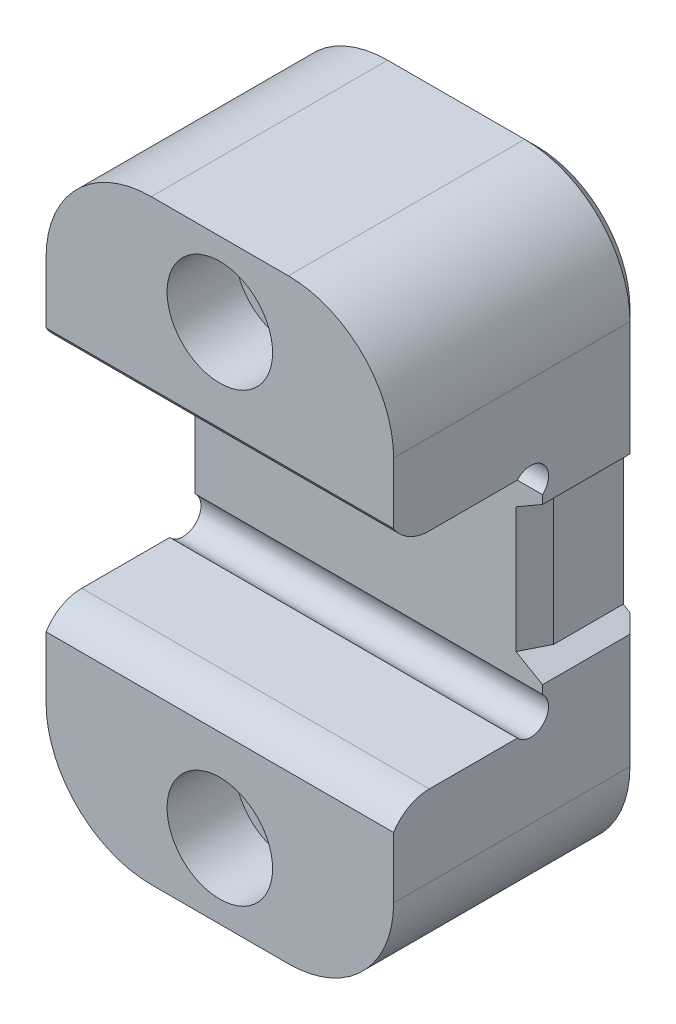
ISO-10303-21;
HEADER;
FILE_DESCRIPTION(('STEP AP214'),'2;1');
FILE_NAME('part.step','',(''),(''),'','','');
FILE_SCHEMA(('AUTOMOTIVE_DESIGN { 1 0 10303 214 1 1 1 1 }'));
ENDSEC;
DATA;
#1=APPLICATION_CONTEXT('core data for automotive mechanical design processes');
#2=APPLICATION_PROTOCOL_DEFINITION('international standard','automotive_design',2000,#1);
#3=PRODUCT_CONTEXT('',#1,'mechanical');
#4=PRODUCT('Part','Part','',(#3));
#5=PRODUCT_RELATED_PRODUCT_CATEGORY('part','',(#4));
#6=PRODUCT_DEFINITION_FORMATION('','',#4);
#7=PRODUCT_DEFINITION_CONTEXT('part definition',#1,'design');
#8=PRODUCT_DEFINITION('design','',#6,#7);
#9=PRODUCT_DEFINITION_SHAPE('','',#8);
#10=(LENGTH_UNIT() NAMED_UNIT(*) SI_UNIT(.MILLI.,.METRE.));
#11=(NAMED_UNIT(*) PLANE_ANGLE_UNIT() SI_UNIT($,.RADIAN.));
#12=(NAMED_UNIT(*) SI_UNIT($,.STERADIAN.) SOLID_ANGLE_UNIT());
#13=UNCERTAINTY_MEASURE_WITH_UNIT(LENGTH_MEASURE(1.E-05),#10,'distance_accuracy_value','');
#14=(GEOMETRIC_REPRESENTATION_CONTEXT(3) GLOBAL_UNCERTAINTY_ASSIGNED_CONTEXT((#13)) GLOBAL_UNIT_ASSIGNED_CONTEXT((#10,
#11,#12)) REPRESENTATION_CONTEXT('',''));
#15=CARTESIAN_POINT('',(0.,0.,0.));
#16=DIRECTION('',(0.,0.,1.));
#17=DIRECTION('',(1.,0.,0.));
#18=AXIS2_PLACEMENT_3D('',#15,#16,#17);
#19=CARTESIAN_POINT('',(22.225,14.2875,-19.05));
#20=DIRECTION('',(0.,0.,-1.));
#21=DIRECTION('',(-1.,0.,0.));
#22=AXIS2_PLACEMENT_3D('',#19,#20,#21);
#23=PLANE('',#22);
#24=DIRECTION('',(0.866025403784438,-0.500000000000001,0.));
#25=VECTOR('',#24,1.);
#26=CARTESIAN_POINT('',(11.7154475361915,-3.91557883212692,-19.05));
#27=LINE('',#26,#25);
#28=CARTESIAN_POINT('',(18.8228635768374,-8.01904739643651,-19.05));
#29=VERTEX_POINT('',#28);
#30=CARTESIAN_POINT('',(22.225,-9.98327177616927,-19.05));
#31=VERTEX_POINT('',#30);
#32=EDGE_CURVE('E427',#29,#31,#27,.T.);
#33=ORIENTED_EDGE('',*,*,#32,.F.);
#34=DIRECTION('',(0.,1.,0.));
#35=VECTOR('',#34,1.);
#36=CARTESIAN_POINT('',(18.8228635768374,8.60845644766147,-19.05));
#37=LINE('',#36,#35);
#38=CARTESIAN_POINT('',(18.8228635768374,8.01904739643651,-19.05));
#39=VERTEX_POINT('',#38);
#40=EDGE_CURVE('E294',#29,#39,#37,.T.);
#41=ORIENTED_EDGE('',*,*,#40,.T.);
#42=DIRECTION('',(-0.866025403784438,-0.500000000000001,0.));
#43=VECTOR('',#42,1.);
#44=CARTESIAN_POINT('',(24.0887854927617,11.059328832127,-19.05));
#45=LINE('',#44,#43);
#46=CARTESIAN_POINT('',(22.225,9.98327177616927,-19.05));
#47=VERTEX_POINT('',#46);
#48=EDGE_CURVE('E425',#47,#39,#45,.T.);
#49=ORIENTED_EDGE('',*,*,#48,.F.);
#50=DIRECTION('',(0.,-1.,0.));
#51=VECTOR('',#50,1.);
#52=CARTESIAN_POINT('',(22.225,14.2875,-19.05));
#53=LINE('',#52,#51);
#54=CARTESIAN_POINT('',(22.225,11.0596162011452,-19.05));
#55=VERTEX_POINT('',#54);
#56=EDGE_CURVE('E436',#55,#47,#53,.T.);
#57=ORIENTED_EDGE('',*,*,#56,.F.);
#58=DIRECTION('',(1.,0.,0.));
#59=VECTOR('',#58,1.);
#60=CARTESIAN_POINT('',(-22.225,11.0596162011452,-19.05));
#61=LINE('',#60,#59);
#62=CARTESIAN_POINT('',(-22.225,11.0596162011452,-19.05));
#63=VERTEX_POINT('',#62);
#64=EDGE_CURVE('E391',#55,#63,#61,.F.);
#65=ORIENTED_EDGE('',*,*,#64,.T.);
#66=DIRECTION('',(0.,-1.,0.));
#67=VECTOR('',#66,1.);
#68=CARTESIAN_POINT('',(-22.225,14.2875,-19.05));
#69=LINE('',#68,#67);
#70=CARTESIAN_POINT('',(-22.225,-11.0596162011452,-19.05));
#71=VERTEX_POINT('',#70);
#72=EDGE_CURVE('E232',#63,#71,#69,.T.);
#73=ORIENTED_EDGE('',*,*,#72,.T.);
#74=DIRECTION('',(1.,0.,0.));
#75=VECTOR('',#74,1.);
#76=CARTESIAN_POINT('',(-22.225,-11.0596162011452,-19.05));
#77=LINE('',#76,#75);
#78=CARTESIAN_POINT('',(22.225,-11.0596162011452,-19.05));
#79=VERTEX_POINT('',#78);
#80=EDGE_CURVE('E212',#71,#79,#77,.T.);
#81=ORIENTED_EDGE('',*,*,#80,.T.);
#82=EDGE_CURVE('E435',#31,#79,#53,.T.);
#83=ORIENTED_EDGE('',*,*,#82,.F.);
#84=EDGE_LOOP('',(#33,#41,#49,#57,#65,#73,#81,#83));
#85=FACE_BOUND('',#84,.T.);
#86=ADVANCED_FACE('F32',(#85),#23,.F.);
#87=CARTESIAN_POINT('',(22.225,38.1,-31.75));
#88=DIRECTION('',(0.,0.,1.));
#89=DIRECTION('',(1.,0.,0.));
#90=AXIS2_PLACEMENT_3D('',#87,#88,#89);
#91=PLANE('',#90);
#92=DIRECTION('',(0.866025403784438,-0.500000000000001,0.));
#93=VECTOR('',#92,1.);
#94=CARTESIAN_POINT('',(19.84375,-8.60845644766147,-31.75));
#95=LINE('',#94,#93);
#96=CARTESIAN_POINT('',(19.84375,-8.60845644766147,-31.75));
#97=VERTEX_POINT('',#96);
#98=CARTESIAN_POINT('',(20.701,-9.10338996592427,-31.75));
#99=VERTEX_POINT('',#98);
#100=EDGE_CURVE('E415',#97,#99,#95,.T.);
#101=ORIENTED_EDGE('',*,*,#100,.T.);
#102=DIRECTION('',(0.,-1.,0.));
#103=VECTOR('',#102,1.);
#104=CARTESIAN_POINT('',(20.701,38.1,-31.75));
#105=LINE('',#104,#103);
#106=CARTESIAN_POINT('',(20.701,-24.638,-31.75));
#107=VERTEX_POINT('',#106);
#108=EDGE_CURVE('E323',#99,#107,#105,.T.);
#109=ORIENTED_EDGE('',*,*,#108,.T.);
#110=CARTESIAN_POINT('',(8.763,-24.638,-31.75));
#111=DIRECTION('',(0.,0.,1.));
#112=DIRECTION('',(1.,0.,0.));
#113=AXIS2_PLACEMENT_3D('',#110,#111,#112);
#114=CIRCLE('',#113,11.938);
#115=CARTESIAN_POINT('',(8.763,-36.576,-31.75));
#116=VERTEX_POINT('',#115);
#117=EDGE_CURVE('E319',#107,#116,#114,.F.);
#118=ORIENTED_EDGE('',*,*,#117,.T.);
#119=DIRECTION('',(-1.,0.,0.));
#120=VECTOR('',#119,1.);
#121=CARTESIAN_POINT('',(22.225,-36.576,-31.75));
#122=LINE('',#121,#120);
#123=CARTESIAN_POINT('',(-8.763,-36.576,-31.75));
#124=VERTEX_POINT('',#123);
#125=EDGE_CURVE('E315',#116,#124,#122,.T.);
#126=ORIENTED_EDGE('',*,*,#125,.T.);
#127=CARTESIAN_POINT('',(-8.763,-24.638,-31.75));
#128=DIRECTION('',(0.,0.,1.));
#129=DIRECTION('',(1.,0.,0.));
#130=AXIS2_PLACEMENT_3D('',#127,#128,#129);
#131=CIRCLE('',#130,11.938);
#132=CARTESIAN_POINT('',(-20.701,-24.638,-31.75));
#133=VERTEX_POINT('',#132);
#134=EDGE_CURVE('E313',#124,#133,#131,.F.);
#135=ORIENTED_EDGE('',*,*,#134,.T.);
#136=DIRECTION('',(0.,1.,0.));
#137=VECTOR('',#136,1.);
#138=CARTESIAN_POINT('',(-20.701,24.638,-31.75));
#139=LINE('',#138,#137);
#140=CARTESIAN_POINT('',(-20.701,24.638,-31.75));
#141=VERTEX_POINT('',#140);
#142=EDGE_CURVE('E309',#133,#141,#139,.T.);
#143=ORIENTED_EDGE('',*,*,#142,.T.);
#144=CARTESIAN_POINT('',(-8.763,24.638,-31.75));
#145=DIRECTION('',(0.,0.,1.));
#146=DIRECTION('',(1.,0.,0.));
#147=AXIS2_PLACEMENT_3D('',#144,#145,#146);
#148=CIRCLE('',#147,11.938);
#149=CARTESIAN_POINT('',(-8.763,36.576,-31.75));
#150=VERTEX_POINT('',#149);
#151=EDGE_CURVE('E307',#141,#150,#148,.F.);
#152=ORIENTED_EDGE('',*,*,#151,.T.);
#153=DIRECTION('',(1.,0.,0.));
#154=VECTOR('',#153,1.);
#155=CARTESIAN_POINT('',(22.225,36.576,-31.75));
#156=LINE('',#155,#154);
#157=CARTESIAN_POINT('',(8.763,36.576,-31.75));
#158=VERTEX_POINT('',#157);
#159=EDGE_CURVE('E311',#150,#158,#156,.T.);
#160=ORIENTED_EDGE('',*,*,#159,.T.);
#161=CARTESIAN_POINT('',(8.763,24.638,-31.75));
#162=DIRECTION('',(0.,0.,1.));
#163=DIRECTION('',(1.,0.,0.));
#164=AXIS2_PLACEMENT_3D('',#161,#162,#163);
#165=CIRCLE('',#164,11.938);
#166=CARTESIAN_POINT('',(20.701,24.638,-31.75));
#167=VERTEX_POINT('',#166);
#168=EDGE_CURVE('E317',#158,#167,#165,.F.);
#169=ORIENTED_EDGE('',*,*,#168,.T.);
#170=DIRECTION('',(0.,-1.,0.));
#171=VECTOR('',#170,1.);
#172=CARTESIAN_POINT('',(20.701,38.1,-31.75));
#173=LINE('',#172,#171);
#174=CARTESIAN_POINT('',(20.701,9.10338996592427,-31.75));
#175=VERTEX_POINT('',#174);
#176=EDGE_CURVE('E321',#167,#175,#173,.T.);
#177=ORIENTED_EDGE('',*,*,#176,.T.);
#178=DIRECTION('',(-0.866025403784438,-0.500000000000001,0.));
#179=VECTOR('',#178,1.);
#180=CARTESIAN_POINT('',(19.84375,8.60845644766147,-31.75));
#181=LINE('',#180,#179);
#182=CARTESIAN_POINT('',(19.84375,8.60845644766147,-31.75));
#183=VERTEX_POINT('',#182);
#184=EDGE_CURVE('E418',#175,#183,#181,.T.);
#185=ORIENTED_EDGE('',*,*,#184,.T.);
#186=DIRECTION('',(0.,-1.,0.));
#187=VECTOR('',#186,1.);
#188=CARTESIAN_POINT('',(19.84375,8.60845644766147,-31.75));
#189=LINE('',#188,#187);
#190=EDGE_CURVE('E411',#183,#97,#189,.T.);
#191=ORIENTED_EDGE('',*,*,#190,.T.);
#192=EDGE_LOOP('',(#101,#109,#118,#126,#135,#143,#152,#160,#169,#177,#185,#191));
#193=FACE_BOUND('',#192,.T.);
#194=CARTESIAN_POINT('',(0.,28.575,-31.75));
#195=DIRECTION('',(0.,0.,1.));
#196=DIRECTION('',(1.,0.,0.));
#197=AXIS2_PLACEMENT_3D('',#194,#195,#196);
#198=CIRCLE('',#197,4.10209999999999);
#199=CARTESIAN_POINT('',(4.10209999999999,28.575,-31.75));
#200=VERTEX_POINT('',#199);
#201=EDGE_CURVE('E288',#200,#200,#198,.T.);
#202=ORIENTED_EDGE('',*,*,#201,.T.);
#203=EDGE_LOOP('',(#202));
#204=FACE_BOUND('',#203,.T.);
#205=CARTESIAN_POINT('',(0.,-28.575,-31.75));
#206=DIRECTION('',(0.,0.,1.));
#207=DIRECTION('',(1.,0.,0.));
#208=AXIS2_PLACEMENT_3D('',#205,#206,#207);
#209=CIRCLE('',#208,4.10209999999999);
#210=CARTESIAN_POINT('',(4.10209999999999,-28.575,-31.75));
#211=VERTEX_POINT('',#210);
#212=EDGE_CURVE('E283',#211,#211,#209,.T.);
#213=ORIENTED_EDGE('',*,*,#212,.T.);
#214=EDGE_LOOP('',(#213));
#215=FACE_BOUND('',#214,.T.);
#216=ADVANCED_FACE('F545',(#193,#204,#215),#91,.F.);
#217=CARTESIAN_POINT('',(22.225,-14.2875,0.));
#218=DIRECTION('',(-1.,0.,0.));
#219=DIRECTION('',(0.,0.,1.));
#220=AXIS2_PLACEMENT_3D('',#217,#218,#219);
#221=PLANE('',#220);
#222=DIRECTION('',(0.,0.,-1.));
#223=VECTOR('',#222,1.);
#224=CARTESIAN_POINT('',(22.225,-24.638,0.));
#225=LINE('',#224,#223);
#226=CARTESIAN_POINT('',(22.225,-24.638,0.));
#227=VERTEX_POINT('',#226);
#228=CARTESIAN_POINT('',(22.225,-24.638,-30.226));
#229=VERTEX_POINT('',#228);
#230=EDGE_CURVE('E250',#227,#229,#225,.T.);
#231=ORIENTED_EDGE('',*,*,#230,.T.);
#232=DIRECTION('',(0.,1.,0.));
#233=VECTOR('',#232,1.);
#234=CARTESIAN_POINT('',(22.225,-14.2875,-30.226));
#235=LINE('',#234,#233);
#236=CARTESIAN_POINT('',(22.225,-9.98327177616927,-30.226));
#237=VERTEX_POINT('',#236);
#238=EDGE_CURVE('E302',#229,#237,#235,.T.);
#239=ORIENTED_EDGE('',*,*,#238,.T.);
#240=DIRECTION('',(0.,0.,-1.));
#241=VECTOR('',#240,1.);
#242=CARTESIAN_POINT('',(22.225,-9.98327177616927,0.));
#243=LINE('',#242,#241);
#244=EDGE_CURVE('E277',#31,#237,#243,.T.);
#245=ORIENTED_EDGE('',*,*,#244,.F.);
#246=ORIENTED_EDGE('',*,*,#82,.T.);
#247=CARTESIAN_POINT('',(22.225,-12.7635,-17.526));
#248=DIRECTION('',(1.,0.,0.));
#249=DIRECTION('',(0.,0.,1.));
#250=AXIS2_PLACEMENT_3D('',#247,#248,#249);
#251=CIRCLE('',#250,2.286);
#252=CARTESIAN_POINT('',(22.225,-14.2875,-15.8221162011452));
#253=VERTEX_POINT('',#252);
#254=EDGE_CURVE('E217',#253,#79,#251,.T.);
#255=ORIENTED_EDGE('',*,*,#254,.F.);
#256=DIRECTION('',(0.,0.,1.));
#257=VECTOR('',#256,1.);
#258=CARTESIAN_POINT('',(22.225,-14.2875,-19.05));
#259=LINE('',#258,#257);
#260=CARTESIAN_POINT('',(22.225,-14.2875,-4.57199999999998));
#261=VERTEX_POINT('',#260);
#262=EDGE_CURVE('E225',#253,#261,#259,.T.);
#263=ORIENTED_EDGE('',*,*,#262,.T.);
#264=CARTESIAN_POINT('',(22.225,-19.6722999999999,-4.57199999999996));
#265=DIRECTION('',(-1.,0.,0.));
#266=DIRECTION('',(0.,0.,1.));
#267=AXIS2_PLACEMENT_3D('',#264,#265,#266);
#268=CIRCLE('',#267,5.38479999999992);
#269=CARTESIAN_POINT('',(22.225,-16.8275,0.));
#270=VERTEX_POINT('',#269);
#271=EDGE_CURVE('E402',#270,#261,#268,.T.);
#272=ORIENTED_EDGE('',*,*,#271,.F.);
#273=DIRECTION('',(0.,-1.,0.));
#274=VECTOR('',#273,1.);
#275=CARTESIAN_POINT('',(22.225,-14.2875,0.));
#276=LINE('',#275,#274);
#277=EDGE_CURVE('E245',#270,#227,#276,.T.);
#278=ORIENTED_EDGE('',*,*,#277,.T.);
#279=EDGE_LOOP('',(#231,#239,#245,#246,#255,#263,#272,#278));
#280=FACE_BOUND('',#279,.T.);
#281=ADVANCED_FACE('F522',(#280),#221,.F.);
#282=DIRECTION('',(0.,0.,1.));
#283=VECTOR('',#282,1.);
#284=CARTESIAN_POINT('',(22.225,9.98327177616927,0.));
#285=LINE('',#284,#283);
#286=CARTESIAN_POINT('',(22.225,9.98327177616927,-30.226));
#287=VERTEX_POINT('',#286);
#288=EDGE_CURVE('E275',#287,#47,#285,.T.);
#289=ORIENTED_EDGE('',*,*,#288,.F.);
#290=DIRECTION('',(0.,1.,0.));
#291=VECTOR('',#290,1.);
#292=CARTESIAN_POINT('',(22.225,-14.2875,-30.226));
#293=LINE('',#292,#291);
#294=CARTESIAN_POINT('',(22.225,24.638,-30.226));
#295=VERTEX_POINT('',#294);
#296=EDGE_CURVE('E325',#287,#295,#293,.T.);
#297=ORIENTED_EDGE('',*,*,#296,.T.);
#298=DIRECTION('',(0.,0.,1.));
#299=VECTOR('',#298,1.);
#300=CARTESIAN_POINT('',(22.225,24.638,0.));
#301=LINE('',#300,#299);
#302=CARTESIAN_POINT('',(22.225,24.638,0.));
#303=VERTEX_POINT('',#302);
#304=EDGE_CURVE('E248',#295,#303,#301,.T.);
#305=ORIENTED_EDGE('',*,*,#304,.T.);
#306=DIRECTION('',(0.,-1.,0.));
#307=VECTOR('',#306,1.);
#308=CARTESIAN_POINT('',(22.225,38.1,0.));
#309=LINE('',#308,#307);
#310=CARTESIAN_POINT('',(22.225,16.8275,0.));
#311=VERTEX_POINT('',#310);
#312=EDGE_CURVE('E235',#303,#311,#309,.T.);
#313=ORIENTED_EDGE('',*,*,#312,.T.);
#314=CARTESIAN_POINT('',(22.225,19.6722999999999,-4.57199999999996));
#315=DIRECTION('',(-1.,0.,0.));
#316=DIRECTION('',(0.,0.,-1.));
#317=AXIS2_PLACEMENT_3D('',#314,#315,#316);
#318=CIRCLE('',#317,5.38479999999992);
#319=CARTESIAN_POINT('',(22.225,14.2875,-4.57199999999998));
#320=VERTEX_POINT('',#319);
#321=EDGE_CURVE('E394',#320,#311,#318,.T.);
#322=ORIENTED_EDGE('',*,*,#321,.F.);
#323=DIRECTION('',(0.,0.,-1.));
#324=VECTOR('',#323,1.);
#325=CARTESIAN_POINT('',(22.225,14.2875,0.));
#326=LINE('',#325,#324);
#327=CARTESIAN_POINT('',(22.225,14.2875,-15.8221162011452));
#328=VERTEX_POINT('',#327);
#329=EDGE_CURVE('E432',#320,#328,#326,.T.);
#330=ORIENTED_EDGE('',*,*,#329,.T.);
#331=CARTESIAN_POINT('',(22.225,12.7635,-17.526));
#332=DIRECTION('',(1.,0.,0.));
#333=DIRECTION('',(0.,0.,-1.));
#334=AXIS2_PLACEMENT_3D('',#331,#332,#333);
#335=CIRCLE('',#334,2.286);
#336=EDGE_CURVE('E386',#55,#328,#335,.T.);
#337=ORIENTED_EDGE('',*,*,#336,.F.);
#338=ORIENTED_EDGE('',*,*,#56,.T.);
#339=EDGE_LOOP('',(#289,#297,#305,#313,#322,#330,#337,#338));
#340=FACE_BOUND('',#339,.T.);
#341=ADVANCED_FACE('F458',(#340),#221,.F.);
#342=CARTESIAN_POINT('',(22.225,38.1,0.));
#343=DIRECTION('',(0.,0.,-1.));
#344=DIRECTION('',(0.,1.,0.));
#345=AXIS2_PLACEMENT_3D('',#342,#343,#344);
#346=PLANE('',#345);
#347=CARTESIAN_POINT('',(0.,28.575,0.));
#348=DIRECTION('',(0.,0.,1.));
#349=DIRECTION('',(1.,0.,0.));
#350=AXIS2_PLACEMENT_3D('',#347,#348,#349);
#351=CIRCLE('',#350,6.74751);
#352=CARTESIAN_POINT('',(6.74751,28.575,0.));
#353=VERTEX_POINT('',#352);
#354=EDGE_CURVE('E286',#353,#353,#351,.T.);
#355=ORIENTED_EDGE('',*,*,#354,.F.);
#356=EDGE_LOOP('',(#355));
#357=FACE_BOUND('',#356,.T.);
#358=DIRECTION('',(0.,-1.,0.));
#359=VECTOR('',#358,1.);
#360=CARTESIAN_POINT('',(-22.225,38.1,0.));
#361=LINE('',#360,#359);
#362=CARTESIAN_POINT('',(-22.225,24.638,0.));
#363=VERTEX_POINT('',#362);
#364=CARTESIAN_POINT('',(-22.225,16.8275,0.));
#365=VERTEX_POINT('',#364);
#366=EDGE_CURVE('E429',#363,#365,#361,.T.);
#367=ORIENTED_EDGE('',*,*,#366,.T.);
#368=DIRECTION('',(1.,0.,0.));
#369=VECTOR('',#368,1.);
#370=CARTESIAN_POINT('',(-22.225,16.8275,0.));
#371=LINE('',#370,#369);
#372=EDGE_CURVE('E398',#365,#311,#371,.T.);
#373=ORIENTED_EDGE('',*,*,#372,.T.);
#374=ORIENTED_EDGE('',*,*,#312,.F.);
#375=CARTESIAN_POINT('',(8.763,24.638,0.));
#376=DIRECTION('',(0.,0.,-1.));
#377=DIRECTION('',(0.,1.,0.));
#378=AXIS2_PLACEMENT_3D('',#375,#376,#377);
#379=CIRCLE('',#378,13.462);
#380=CARTESIAN_POINT('',(8.763,38.1,0.));
#381=VERTEX_POINT('',#380);
#382=EDGE_CURVE('E265',#303,#381,#379,.F.);
#383=ORIENTED_EDGE('',*,*,#382,.T.);
#384=DIRECTION('',(-1.,0.,0.));
#385=VECTOR('',#384,1.);
#386=CARTESIAN_POINT('',(22.225,38.1,0.));
#387=LINE('',#386,#385);
#388=CARTESIAN_POINT('',(-8.763,38.1,0.));
#389=VERTEX_POINT('',#388);
#390=EDGE_CURVE('E241',#381,#389,#387,.T.);
#391=ORIENTED_EDGE('',*,*,#390,.T.);
#392=CARTESIAN_POINT('',(-8.763,24.638,0.));
#393=DIRECTION('',(0.,0.,-1.));
#394=DIRECTION('',(0.,1.,0.));
#395=AXIS2_PLACEMENT_3D('',#392,#393,#394);
#396=CIRCLE('',#395,13.462);
#397=EDGE_CURVE('E263',#389,#363,#396,.F.);
#398=ORIENTED_EDGE('',*,*,#397,.T.);
#399=EDGE_LOOP('',(#367,#373,#374,#383,#391,#398));
#400=FACE_BOUND('',#399,.T.);
#401=ADVANCED_FACE('F465',(#357,#400),#346,.F.);
#402=CARTESIAN_POINT('',(22.225,14.2875,0.));
#403=DIRECTION('',(0.,1.,0.));
#404=DIRECTION('',(0.,0.,1.));
#405=AXIS2_PLACEMENT_3D('',#402,#403,#404);
#406=PLANE('',#405);
#407=DIRECTION('',(0.,0.,-1.));
#408=VECTOR('',#407,1.);
#409=CARTESIAN_POINT('',(-22.225,14.2875,0.));
#410=LINE('',#409,#408);
#411=CARTESIAN_POINT('',(-22.225,14.2875,-4.57199999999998));
#412=VERTEX_POINT('',#411);
#413=CARTESIAN_POINT('',(-22.225,14.2875,-15.8221162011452));
#414=VERTEX_POINT('',#413);
#415=EDGE_CURVE('E237',#412,#414,#410,.T.);
#416=ORIENTED_EDGE('',*,*,#415,.T.);
#417=DIRECTION('',(1.,0.,0.));
#418=VECTOR('',#417,1.);
#419=CARTESIAN_POINT('',(-22.225,14.2875,-15.8221162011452));
#420=LINE('',#419,#418);
#421=EDGE_CURVE('E388',#414,#328,#420,.T.);
#422=ORIENTED_EDGE('',*,*,#421,.T.);
#423=ORIENTED_EDGE('',*,*,#329,.F.);
#424=DIRECTION('',(1.,0.,0.));
#425=VECTOR('',#424,1.);
#426=CARTESIAN_POINT('',(-22.225,14.2875,-4.57199999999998));
#427=LINE('',#426,#425);
#428=EDGE_CURVE('E400',#412,#320,#427,.T.);
#429=ORIENTED_EDGE('',*,*,#428,.F.);
#430=EDGE_LOOP('',(#416,#422,#423,#429));
#431=FACE_BOUND('',#430,.T.);
#432=ADVANCED_FACE('F446',(#431),#406,.F.);
#433=CARTESIAN_POINT('',(22.225,-14.2875,-19.05));
#434=DIRECTION('',(0.,-1.,0.));
#435=DIRECTION('',(0.,0.,-1.));
#436=AXIS2_PLACEMENT_3D('',#433,#434,#435);
#437=PLANE('',#436);
#438=ORIENTED_EDGE('',*,*,#262,.F.);
#439=DIRECTION('',(1.,0.,0.));
#440=VECTOR('',#439,1.);
#441=CARTESIAN_POINT('',(-22.225,-14.2875,-15.8221162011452));
#442=LINE('',#441,#440);
#443=CARTESIAN_POINT('',(-22.225,-14.2875,-15.8221162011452));
#444=VERTEX_POINT('',#443);
#445=EDGE_CURVE('E209',#253,#444,#442,.F.);
#446=ORIENTED_EDGE('',*,*,#445,.T.);
#447=DIRECTION('',(0.,0.,1.));
#448=VECTOR('',#447,1.);
#449=CARTESIAN_POINT('',(-22.225,-14.2875,-19.05));
#450=LINE('',#449,#448);
#451=CARTESIAN_POINT('',(-22.225,-14.2875,-4.57199999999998));
#452=VERTEX_POINT('',#451);
#453=EDGE_CURVE('E223',#444,#452,#450,.T.);
#454=ORIENTED_EDGE('',*,*,#453,.T.);
#455=DIRECTION('',(1.,0.,0.));
#456=VECTOR('',#455,1.);
#457=CARTESIAN_POINT('',(-22.225,-14.2875,-4.57199999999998));
#458=LINE('',#457,#456);
#459=EDGE_CURVE('E406',#452,#261,#458,.T.);
#460=ORIENTED_EDGE('',*,*,#459,.T.);
#461=EDGE_LOOP('',(#438,#446,#454,#460));
#462=FACE_BOUND('',#461,.T.);
#463=ADVANCED_FACE('F221',(#462),#437,.F.);
#464=CARTESIAN_POINT('',(22.225,-14.2875,0.));
#465=DIRECTION('',(0.,0.,-1.));
#466=DIRECTION('',(0.,1.,0.));
#467=AXIS2_PLACEMENT_3D('',#464,#465,#466);
#468=PLANE('',#467);
#469=CARTESIAN_POINT('',(0.,-28.575,0.));
#470=DIRECTION('',(0.,0.,1.));
#471=DIRECTION('',(1.,0.,0.));
#472=AXIS2_PLACEMENT_3D('',#469,#470,#471);
#473=CIRCLE('',#472,6.74751);
#474=CARTESIAN_POINT('',(6.74751,-28.575,0.));
#475=VERTEX_POINT('',#474);
#476=EDGE_CURVE('E378',#475,#475,#473,.T.);
#477=ORIENTED_EDGE('',*,*,#476,.F.);
#478=EDGE_LOOP('',(#477));
#479=FACE_BOUND('',#478,.T.);
#480=ORIENTED_EDGE('',*,*,#277,.F.);
#481=DIRECTION('',(1.,0.,0.));
#482=VECTOR('',#481,1.);
#483=CARTESIAN_POINT('',(-22.225,-16.8275,0.));
#484=LINE('',#483,#482);
#485=CARTESIAN_POINT('',(-22.225,-16.8275,0.));
#486=VERTEX_POINT('',#485);
#487=EDGE_CURVE('E409',#486,#270,#484,.T.);
#488=ORIENTED_EDGE('',*,*,#487,.F.);
#489=DIRECTION('',(0.,-1.,0.));
#490=VECTOR('',#489,1.);
#491=CARTESIAN_POINT('',(-22.225,-14.2875,0.));
#492=LINE('',#491,#490);
#493=CARTESIAN_POINT('',(-22.225,-24.638,0.));
#494=VERTEX_POINT('',#493);
#495=EDGE_CURVE('E231',#486,#494,#492,.T.);
#496=ORIENTED_EDGE('',*,*,#495,.T.);
#497=CARTESIAN_POINT('',(-8.763,-24.638,0.));
#498=DIRECTION('',(0.,0.,-1.));
#499=DIRECTION('',(0.,1.,0.));
#500=AXIS2_PLACEMENT_3D('',#497,#498,#499);
#501=CIRCLE('',#500,13.462);
#502=CARTESIAN_POINT('',(-8.763,-38.1,0.));
#503=VERTEX_POINT('',#502);
#504=EDGE_CURVE('E258',#494,#503,#501,.F.);
#505=ORIENTED_EDGE('',*,*,#504,.T.);
#506=DIRECTION('',(-1.,0.,0.));
#507=VECTOR('',#506,1.);
#508=CARTESIAN_POINT('',(22.225,-38.1,0.));
#509=LINE('',#508,#507);
#510=CARTESIAN_POINT('',(8.763,-38.1,0.));
#511=VERTEX_POINT('',#510);
#512=EDGE_CURVE('E244',#511,#503,#509,.T.);
#513=ORIENTED_EDGE('',*,*,#512,.F.);
#514=CARTESIAN_POINT('',(8.763,-24.638,0.));
#515=DIRECTION('',(0.,0.,-1.));
#516=DIRECTION('',(0.,1.,0.));
#517=AXIS2_PLACEMENT_3D('',#514,#515,#516);
#518=CIRCLE('',#517,13.462);
#519=EDGE_CURVE('E260',#511,#227,#518,.F.);
#520=ORIENTED_EDGE('',*,*,#519,.T.);
#521=EDGE_LOOP('',(#480,#488,#496,#505,#513,#520));
#522=FACE_BOUND('',#521,.T.);
#523=ADVANCED_FACE('F496',(#479,#522),#468,.F.);
#524=CARTESIAN_POINT('',(22.225,-38.1,0.));
#525=DIRECTION('',(0.,1.,0.));
#526=DIRECTION('',(0.,0.,1.));
#527=AXIS2_PLACEMENT_3D('',#524,#525,#526);
#528=PLANE('',#527);
#529=DIRECTION('',(0.,0.,-1.));
#530=VECTOR('',#529,1.);
#531=CARTESIAN_POINT('',(-8.763,-38.1,-31.75));
#532=LINE('',#531,#530);
#533=CARTESIAN_POINT('',(-8.763,-38.1,-30.226));
#534=VERTEX_POINT('',#533);
#535=EDGE_CURVE('E253',#503,#534,#532,.T.);
#536=ORIENTED_EDGE('',*,*,#535,.T.);
#537=DIRECTION('',(1.,0.,0.));
#538=VECTOR('',#537,1.);
#539=CARTESIAN_POINT('',(22.225,-38.1,-30.226));
#540=LINE('',#539,#538);
#541=CARTESIAN_POINT('',(8.763,-38.1,-30.226));
#542=VERTEX_POINT('',#541);
#543=EDGE_CURVE('E333',#534,#542,#540,.T.);
#544=ORIENTED_EDGE('',*,*,#543,.T.);
#545=DIRECTION('',(0.,0.,-1.));
#546=VECTOR('',#545,1.);
#547=CARTESIAN_POINT('',(8.763,-38.1,0.));
#548=LINE('',#547,#546);
#549=EDGE_CURVE('E256',#542,#511,#548,.F.);
#550=ORIENTED_EDGE('',*,*,#549,.T.);
#551=ORIENTED_EDGE('',*,*,#512,.T.);
#552=EDGE_LOOP('',(#536,#544,#550,#551));
#553=FACE_BOUND('',#552,.T.);
#554=ADVANCED_FACE('F500',(#553),#528,.F.);
#555=CARTESIAN_POINT('',(22.225,38.1,0.));
#556=DIRECTION('',(0.,-1.,0.));
#557=DIRECTION('',(0.,0.,-1.));
#558=AXIS2_PLACEMENT_3D('',#555,#556,#557);
#559=PLANE('',#558);
#560=DIRECTION('',(0.,0.,1.));
#561=VECTOR('',#560,1.);
#562=CARTESIAN_POINT('',(8.763,38.1,0.));
#563=LINE('',#562,#561);
#564=CARTESIAN_POINT('',(8.763,38.1,-30.226));
#565=VERTEX_POINT('',#564);
#566=EDGE_CURVE('E269',#381,#565,#563,.F.);
#567=ORIENTED_EDGE('',*,*,#566,.T.);
#568=DIRECTION('',(-1.,0.,0.));
#569=VECTOR('',#568,1.);
#570=CARTESIAN_POINT('',(22.225,38.1,-30.226));
#571=LINE('',#570,#569);
#572=CARTESIAN_POINT('',(-8.763,38.1,-30.226));
#573=VERTEX_POINT('',#572);
#574=EDGE_CURVE('E55',#565,#573,#571,.T.);
#575=ORIENTED_EDGE('',*,*,#574,.T.);
#576=DIRECTION('',(0.,0.,1.));
#577=VECTOR('',#576,1.);
#578=CARTESIAN_POINT('',(-8.763,38.1,0.));
#579=LINE('',#578,#577);
#580=EDGE_CURVE('E267',#573,#389,#579,.T.);
#581=ORIENTED_EDGE('',*,*,#580,.T.);
#582=ORIENTED_EDGE('',*,*,#390,.F.);
#583=EDGE_LOOP('',(#567,#575,#581,#582));
#584=FACE_BOUND('',#583,.T.);
#585=ADVANCED_FACE('F473',(#584),#559,.F.);
#586=CARTESIAN_POINT('',(-22.225,-14.2875,0.));
#587=DIRECTION('',(-1.,0.,0.));
#588=DIRECTION('',(0.,0.,1.));
#589=AXIS2_PLACEMENT_3D('',#586,#587,#588);
#590=PLANE('',#589);
#591=DIRECTION('',(0.,0.,1.));
#592=VECTOR('',#591,1.);
#593=CARTESIAN_POINT('',(-22.225,24.638,-31.75));
#594=LINE('',#593,#592);
#595=CARTESIAN_POINT('',(-22.225,24.638,-30.226));
#596=VERTEX_POINT('',#595);
#597=EDGE_CURVE('E271',#363,#596,#594,.F.);
#598=ORIENTED_EDGE('',*,*,#597,.T.);
#599=DIRECTION('',(0.,-1.,0.));
#600=VECTOR('',#599,1.);
#601=CARTESIAN_POINT('',(-22.225,-24.638,-30.226));
#602=LINE('',#601,#600);
#603=CARTESIAN_POINT('',(-22.225,-24.638,-30.226));
#604=VERTEX_POINT('',#603);
#605=EDGE_CURVE('E41',#596,#604,#602,.T.);
#606=ORIENTED_EDGE('',*,*,#605,.T.);
#607=DIRECTION('',(0.,0.,-1.));
#608=VECTOR('',#607,1.);
#609=CARTESIAN_POINT('',(-22.225,-24.638,0.));
#610=LINE('',#609,#608);
#611=EDGE_CURVE('E273',#604,#494,#610,.F.);
#612=ORIENTED_EDGE('',*,*,#611,.T.);
#613=ORIENTED_EDGE('',*,*,#495,.F.);
#614=CARTESIAN_POINT('',(-22.225,-19.6722999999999,-4.57199999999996));
#615=DIRECTION('',(-1.,0.,0.));
#616=DIRECTION('',(0.,0.,1.));
#617=AXIS2_PLACEMENT_3D('',#614,#615,#616);
#618=CIRCLE('',#617,5.38479999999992);
#619=EDGE_CURVE('E230',#486,#452,#618,.T.);
#620=ORIENTED_EDGE('',*,*,#619,.T.);
#621=ORIENTED_EDGE('',*,*,#453,.F.);
#622=CARTESIAN_POINT('',(-22.225,-12.7635,-17.526));
#623=DIRECTION('',(1.,0.,0.));
#624=DIRECTION('',(0.,0.,1.));
#625=AXIS2_PLACEMENT_3D('',#622,#623,#624);
#626=CIRCLE('',#625,2.286);
#627=EDGE_CURVE('E206',#444,#71,#626,.T.);
#628=ORIENTED_EDGE('',*,*,#627,.T.);
#629=ORIENTED_EDGE('',*,*,#72,.F.);
#630=CARTESIAN_POINT('',(-22.225,12.7635,-17.526));
#631=DIRECTION('',(-1.,0.,0.));
#632=DIRECTION('',(0.,0.,1.));
#633=AXIS2_PLACEMENT_3D('',#630,#631,#632);
#634=CIRCLE('',#633,2.286);
#635=EDGE_CURVE('E280',#414,#63,#634,.T.);
#636=ORIENTED_EDGE('',*,*,#635,.F.);
#637=ORIENTED_EDGE('',*,*,#415,.F.);
#638=CARTESIAN_POINT('',(-22.225,19.6722999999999,-4.57199999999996));
#639=DIRECTION('',(-1.,0.,0.));
#640=DIRECTION('',(0.,0.,-1.));
#641=AXIS2_PLACEMENT_3D('',#638,#639,#640);
#642=CIRCLE('',#641,5.38479999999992);
#643=EDGE_CURVE('E395',#412,#365,#642,.T.);
#644=ORIENTED_EDGE('',*,*,#643,.T.);
#645=ORIENTED_EDGE('',*,*,#366,.F.);
#646=EDGE_LOOP('',(#598,#606,#612,#613,#620,#621,#628,#629,#636,#637,#644,#645));
#647=FACE_BOUND('',#646,.T.);
#648=ADVANCED_FACE('F228',(#647),#590,.T.);
#649=CARTESIAN_POINT('',(8.763,-24.638,0.));
#650=DIRECTION('',(0.,0.,-1.));
#651=DIRECTION('',(-1.,0.,0.));
#652=AXIS2_PLACEMENT_3D('',#649,#650,#651);
#653=CYLINDRICAL_SURFACE('',#652,13.462);
#654=ORIENTED_EDGE('',*,*,#549,.F.);
#655=CARTESIAN_POINT('',(8.763,-24.638,-30.226));
#656=DIRECTION('',(0.,0.,1.));
#657=DIRECTION('',(1.,0.,0.));
#658=AXIS2_PLACEMENT_3D('',#655,#656,#657);
#659=CIRCLE('',#658,13.462);
#660=EDGE_CURVE('E329',#542,#229,#659,.T.);
#661=ORIENTED_EDGE('',*,*,#660,.T.);
#662=ORIENTED_EDGE('',*,*,#230,.F.);
#663=ORIENTED_EDGE('',*,*,#519,.F.);
#664=EDGE_LOOP('',(#654,#661,#662,#663));
#665=FACE_BOUND('',#664,.T.);
#666=ADVANCED_FACE('F506',(#665),#653,.T.);
#667=CARTESIAN_POINT('',(8.763,24.638,0.));
#668=DIRECTION('',(0.,0.,1.));
#669=DIRECTION('',(1.,0.,0.));
#670=AXIS2_PLACEMENT_3D('',#667,#668,#669);
#671=CYLINDRICAL_SURFACE('',#670,13.462);
#672=ORIENTED_EDGE('',*,*,#304,.F.);
#673=CARTESIAN_POINT('',(8.763,24.638,-30.226));
#674=DIRECTION('',(0.,0.,1.));
#675=DIRECTION('',(1.,0.,0.));
#676=AXIS2_PLACEMENT_3D('',#673,#674,#675);
#677=CIRCLE('',#676,13.462);
#678=EDGE_CURVE('E331',#295,#565,#677,.T.);
#679=ORIENTED_EDGE('',*,*,#678,.T.);
#680=ORIENTED_EDGE('',*,*,#566,.F.);
#681=ORIENTED_EDGE('',*,*,#382,.F.);
#682=EDGE_LOOP('',(#672,#679,#680,#681));
#683=FACE_BOUND('',#682,.T.);
#684=ADVANCED_FACE('F476',(#683),#671,.T.);
#685=CARTESIAN_POINT('',(-8.763,-24.638,0.));
#686=DIRECTION('',(0.,0.,1.));
#687=DIRECTION('',(1.,0.,0.));
#688=AXIS2_PLACEMENT_3D('',#685,#686,#687);
#689=CYLINDRICAL_SURFACE('',#688,13.462);
#690=ORIENTED_EDGE('',*,*,#611,.F.);
#691=CARTESIAN_POINT('',(-8.763,-24.638,-30.226));
#692=DIRECTION('',(0.,0.,1.));
#693=DIRECTION('',(1.,0.,0.));
#694=AXIS2_PLACEMENT_3D('',#691,#692,#693);
#695=CIRCLE('',#694,13.462);
#696=EDGE_CURVE('E335',#604,#534,#695,.T.);
#697=ORIENTED_EDGE('',*,*,#696,.T.);
#698=ORIENTED_EDGE('',*,*,#535,.F.);
#699=ORIENTED_EDGE('',*,*,#504,.F.);
#700=EDGE_LOOP('',(#690,#697,#698,#699));
#701=FACE_BOUND('',#700,.T.);
#702=ADVANCED_FACE('F491',(#701),#689,.T.);
#703=CARTESIAN_POINT('',(-8.763,24.638,0.));
#704=DIRECTION('',(0.,0.,-1.));
#705=DIRECTION('',(-1.,0.,0.));
#706=AXIS2_PLACEMENT_3D('',#703,#704,#705);
#707=CYLINDRICAL_SURFACE('',#706,13.462);
#708=ORIENTED_EDGE('',*,*,#580,.F.);
#709=CARTESIAN_POINT('',(-8.763,24.638,-30.226));
#710=DIRECTION('',(0.,0.,1.));
#711=DIRECTION('',(1.,0.,0.));
#712=AXIS2_PLACEMENT_3D('',#709,#710,#711);
#713=CIRCLE('',#712,13.462);
#714=EDGE_CURVE('E11',#573,#596,#713,.T.);
#715=ORIENTED_EDGE('',*,*,#714,.T.);
#716=ORIENTED_EDGE('',*,*,#597,.F.);
#717=ORIENTED_EDGE('',*,*,#397,.F.);
#718=EDGE_LOOP('',(#708,#715,#716,#717));
#719=FACE_BOUND('',#718,.T.);
#720=ADVANCED_FACE('F468',(#719),#707,.T.);
#721=CARTESIAN_POINT('',(19.84375,8.60845644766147,0.));
#722=DIRECTION('',(1.,0.,0.));
#723=DIRECTION('',(0.,0.,-1.));
#724=AXIS2_PLACEMENT_3D('',#721,#722,#723);
#725=PLANE('',#724);
#726=DIRECTION('',(0.,0.,-1.));
#727=VECTOR('',#726,1.);
#728=CARTESIAN_POINT('',(19.84375,8.60845644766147,0.));
#729=LINE('',#728,#727);
#730=CARTESIAN_POINT('',(19.84375,8.60845644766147,-22.8600000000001));
#731=VERTEX_POINT('',#730);
#732=EDGE_CURVE('E420',#731,#183,#729,.T.);
#733=ORIENTED_EDGE('',*,*,#732,.F.);
#734=DIRECTION('',(0.,-1.,0.));
#735=VECTOR('',#734,1.);
#736=CARTESIAN_POINT('',(19.84375,-8.60845644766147,-22.8600000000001));
#737=LINE('',#736,#735);
#738=CARTESIAN_POINT('',(19.84375,-8.60845644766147,-22.8600000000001));
#739=VERTEX_POINT('',#738);
#740=EDGE_CURVE('E282',#731,#739,#737,.T.);
#741=ORIENTED_EDGE('',*,*,#740,.T.);
#742=DIRECTION('',(0.,0.,-1.));
#743=VECTOR('',#742,1.);
#744=CARTESIAN_POINT('',(19.84375,-8.60845644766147,0.));
#745=LINE('',#744,#743);
#746=EDGE_CURVE('E423',#739,#97,#745,.T.);
#747=ORIENTED_EDGE('',*,*,#746,.T.);
#748=ORIENTED_EDGE('',*,*,#190,.F.);
#749=EDGE_LOOP('',(#733,#741,#747,#748));
#750=FACE_BOUND('',#749,.T.);
#751=ADVANCED_FACE('F568',(#750),#725,.T.);
#752=CARTESIAN_POINT('',(19.84375,-8.60845644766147,0.));
#753=DIRECTION('',(0.500000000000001,0.866025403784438,0.));
#754=DIRECTION('',(-0.866025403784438,0.500000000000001,0.));
#755=AXIS2_PLACEMENT_3D('',#752,#753,#754);
#756=PLANE('',#755);
#757=ORIENTED_EDGE('',*,*,#244,.T.);
#758=DIRECTION('',(0.654653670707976,-0.377964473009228,0.654653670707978));
#759=VECTOR('',#758,1.);
#760=CARTESIAN_POINT('',(33.8182857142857,-16.6766584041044,-18.6327142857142));
#761=LINE('',#760,#759);
#762=EDGE_CURVE('E305',#237,#99,#761,.F.);
#763=ORIENTED_EDGE('',*,*,#762,.T.);
#764=ORIENTED_EDGE('',*,*,#100,.F.);
#765=ORIENTED_EDGE('',*,*,#746,.F.);
#766=DIRECTION('',(-0.255976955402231,0.147788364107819,0.955319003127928));
#767=VECTOR('',#766,1.);
#768=CARTESIAN_POINT('',(19.1924270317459,-8.23241495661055,-20.429229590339));
#769=LINE('',#768,#767);
#770=EDGE_CURVE('E297',#739,#29,#769,.T.);
#771=ORIENTED_EDGE('',*,*,#770,.T.);
#772=ORIENTED_EDGE('',*,*,#32,.T.);
#773=EDGE_LOOP('',(#757,#763,#764,#765,#771,#772));
#774=FACE_BOUND('',#773,.T.);
#775=ADVANCED_FACE('F526',(#774),#756,.T.);
#776=CARTESIAN_POINT('',(19.84375,8.60845644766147,0.));
#777=DIRECTION('',(0.500000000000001,-0.866025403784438,0.));
#778=DIRECTION('',(0.866025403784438,0.500000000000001,0.));
#779=AXIS2_PLACEMENT_3D('',#776,#777,#778);
#780=PLANE('',#779);
#781=ORIENTED_EDGE('',*,*,#184,.F.);
#782=DIRECTION('',(-0.654653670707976,-0.377964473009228,-0.654653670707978));
#783=VECTOR('',#782,1.);
#784=CARTESIAN_POINT('',(33.8182857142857,16.6766584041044,-18.6327142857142));
#785=LINE('',#784,#783);
#786=EDGE_CURVE('E327',#175,#287,#785,.F.);
#787=ORIENTED_EDGE('',*,*,#786,.T.);
#788=ORIENTED_EDGE('',*,*,#288,.T.);
#789=ORIENTED_EDGE('',*,*,#48,.T.);
#790=DIRECTION('',(0.255976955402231,0.147788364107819,-0.955319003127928));
#791=VECTOR('',#790,1.);
#792=CARTESIAN_POINT('',(19.84375,8.60845644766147,-22.8600000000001));
#793=LINE('',#792,#791);
#794=EDGE_CURVE('E300',#39,#731,#793,.T.);
#795=ORIENTED_EDGE('',*,*,#794,.T.);
#796=ORIENTED_EDGE('',*,*,#732,.T.);
#797=EDGE_LOOP('',(#781,#787,#788,#789,#795,#796));
#798=FACE_BOUND('',#797,.T.);
#799=ADVANCED_FACE('F535',(#798),#780,.T.);
#800=CARTESIAN_POINT('',(-22.225,-19.6722999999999,-4.57199999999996));
#801=DIRECTION('',(1.,0.,0.));
#802=DIRECTION('',(0.,0.,-1.));
#803=AXIS2_PLACEMENT_3D('',#800,#801,#802);
#804=CYLINDRICAL_SURFACE('',#803,5.38479999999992);
#805=ORIENTED_EDGE('',*,*,#271,.T.);
#806=ORIENTED_EDGE('',*,*,#459,.F.);
#807=ORIENTED_EDGE('',*,*,#619,.F.);
#808=ORIENTED_EDGE('',*,*,#487,.T.);
#809=EDGE_LOOP('',(#805,#806,#807,#808));
#810=FACE_BOUND('',#809,.T.);
#811=ADVANCED_FACE('F533',(#810),#804,.T.);
#812=CARTESIAN_POINT('',(-22.225,19.6722999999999,-4.57199999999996));
#813=DIRECTION('',(1.,0.,0.));
#814=DIRECTION('',(0.,0.,-1.));
#815=AXIS2_PLACEMENT_3D('',#812,#813,#814);
#816=CYLINDRICAL_SURFACE('',#815,5.38479999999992);
#817=ORIENTED_EDGE('',*,*,#321,.T.);
#818=ORIENTED_EDGE('',*,*,#372,.F.);
#819=ORIENTED_EDGE('',*,*,#643,.F.);
#820=ORIENTED_EDGE('',*,*,#428,.T.);
#821=EDGE_LOOP('',(#817,#818,#819,#820));
#822=FACE_BOUND('',#821,.T.);
#823=ADVANCED_FACE('F463',(#822),#816,.T.);
#824=CARTESIAN_POINT('',(-22.225,12.7635,-17.526));
#825=DIRECTION('',(1.,0.,0.));
#826=DIRECTION('',(0.,0.,-1.));
#827=AXIS2_PLACEMENT_3D('',#824,#825,#826);
#828=CYLINDRICAL_SURFACE('',#827,2.286);
#829=ORIENTED_EDGE('',*,*,#336,.T.);
#830=ORIENTED_EDGE('',*,*,#421,.F.);
#831=ORIENTED_EDGE('',*,*,#635,.T.);
#832=ORIENTED_EDGE('',*,*,#64,.F.);
#833=EDGE_LOOP('',(#829,#830,#831,#832));
#834=FACE_BOUND('',#833,.T.);
#835=ADVANCED_FACE('F451',(#834),#828,.F.);
#836=CARTESIAN_POINT('',(-22.225,-12.7635,-17.526));
#837=DIRECTION('',(1.,0.,0.));
#838=DIRECTION('',(0.,0.,-1.));
#839=AXIS2_PLACEMENT_3D('',#836,#837,#838);
#840=CYLINDRICAL_SURFACE('',#839,2.286);
#841=ORIENTED_EDGE('',*,*,#627,.F.);
#842=ORIENTED_EDGE('',*,*,#445,.F.);
#843=ORIENTED_EDGE('',*,*,#254,.T.);
#844=ORIENTED_EDGE('',*,*,#80,.F.);
#845=EDGE_LOOP('',(#841,#842,#843,#844));
#846=FACE_BOUND('',#845,.T.);
#847=ADVANCED_FACE('F208',(#846),#840,.F.);
#848=CARTESIAN_POINT('',(3.9624,-28.575,-8.73252));
#849=DIRECTION('',(0.,0.,-1.));
#850=DIRECTION('',(-1.,0.,0.));
#851=AXIS2_PLACEMENT_3D('',#848,#849,#850);
#852=PLANE('',#851);
#853=CARTESIAN_POINT('',(0.,-28.575,-8.73252));
#854=DIRECTION('',(0.,0.,1.));
#855=DIRECTION('',(1.,0.,0.));
#856=AXIS2_PLACEMENT_3D('',#853,#854,#855);
#857=CIRCLE('',#856,4.1021);
#858=CARTESIAN_POINT('',(4.1021,-28.575,-8.73252));
#859=VERTEX_POINT('',#858);
#860=EDGE_CURVE('E287',#859,#859,#857,.T.);
#861=ORIENTED_EDGE('',*,*,#860,.F.);
#862=EDGE_LOOP('',(#861));
#863=FACE_BOUND('',#862,.T.);
#864=CARTESIAN_POINT('',(0.,-28.575,-8.73252));
#865=DIRECTION('',(0.,0.,1.));
#866=DIRECTION('',(1.,0.,0.));
#867=AXIS2_PLACEMENT_3D('',#864,#865,#866);
#868=CIRCLE('',#867,6.74751);
#869=CARTESIAN_POINT('',(6.74751,-28.575,-8.73252));
#870=VERTEX_POINT('',#869);
#871=EDGE_CURVE('E381',#870,#870,#868,.T.);
#872=ORIENTED_EDGE('',*,*,#871,.T.);
#873=EDGE_LOOP('',(#872));
#874=FACE_BOUND('',#873,.T.);
#875=ADVANCED_FACE('F629',(#863,#874),#852,.F.);
#876=CARTESIAN_POINT('',(0.,-28.575,0.));
#877=DIRECTION('',(0.,0.,1.));
#878=DIRECTION('',(1.,0.,0.));
#879=AXIS2_PLACEMENT_3D('',#876,#877,#878);
#880=CYLINDRICAL_SURFACE('',#879,6.74751);
#881=ORIENTED_EDGE('',*,*,#871,.F.);
#882=EDGE_LOOP('',(#881));
#883=FACE_BOUND('',#882,.T.);
#884=ORIENTED_EDGE('',*,*,#476,.T.);
#885=EDGE_LOOP('',(#884));
#886=FACE_BOUND('',#885,.T.);
#887=ADVANCED_FACE('F626',(#883,#886),#880,.F.);
#888=CARTESIAN_POINT('',(3.9624,28.575,-8.73252));
#889=DIRECTION('',(0.,0.,-1.));
#890=DIRECTION('',(-1.,0.,0.));
#891=AXIS2_PLACEMENT_3D('',#888,#889,#890);
#892=PLANE('',#891);
#893=CARTESIAN_POINT('',(0.,28.575,-8.73252));
#894=DIRECTION('',(0.,0.,1.));
#895=DIRECTION('',(1.,0.,0.));
#896=AXIS2_PLACEMENT_3D('',#893,#894,#895);
#897=CIRCLE('',#896,4.1021);
#898=CARTESIAN_POINT('',(4.1021,28.575,-8.73252));
#899=VERTEX_POINT('',#898);
#900=EDGE_CURVE('E291',#899,#899,#897,.T.);
#901=ORIENTED_EDGE('',*,*,#900,.F.);
#902=EDGE_LOOP('',(#901));
#903=FACE_BOUND('',#902,.T.);
#904=CARTESIAN_POINT('',(0.,28.575,-8.73252));
#905=DIRECTION('',(0.,0.,1.));
#906=DIRECTION('',(1.,0.,0.));
#907=AXIS2_PLACEMENT_3D('',#904,#905,#906);
#908=CIRCLE('',#907,6.74751);
#909=CARTESIAN_POINT('',(6.74751,28.575,-8.73252));
#910=VERTEX_POINT('',#909);
#911=EDGE_CURVE('E375',#910,#910,#908,.T.);
#912=ORIENTED_EDGE('',*,*,#911,.T.);
#913=EDGE_LOOP('',(#912));
#914=FACE_BOUND('',#913,.T.);
#915=ADVANCED_FACE('F628',(#903,#914),#892,.F.);
#916=CARTESIAN_POINT('',(0.,28.575,0.));
#917=DIRECTION('',(0.,0.,1.));
#918=DIRECTION('',(1.,0.,0.));
#919=AXIS2_PLACEMENT_3D('',#916,#917,#918);
#920=CYLINDRICAL_SURFACE('',#919,6.74751);
#921=ORIENTED_EDGE('',*,*,#911,.F.);
#922=EDGE_LOOP('',(#921));
#923=FACE_BOUND('',#922,.T.);
#924=ORIENTED_EDGE('',*,*,#354,.T.);
#925=EDGE_LOOP('',(#924));
#926=FACE_BOUND('',#925,.T.);
#927=ADVANCED_FACE('F636',(#923,#926),#920,.F.);
#928=CARTESIAN_POINT('',(0.,-28.575,-8.73252));
#929=DIRECTION('',(0.,0.,1.));
#930=DIRECTION('',(1.,0.,0.));
#931=AXIS2_PLACEMENT_3D('',#928,#929,#930);
#932=CYLINDRICAL_SURFACE('',#931,4.10209999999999);
#933=ORIENTED_EDGE('',*,*,#860,.T.);
#934=EDGE_LOOP('',(#933));
#935=FACE_BOUND('',#934,.T.);
#936=ORIENTED_EDGE('',*,*,#212,.F.);
#937=EDGE_LOOP('',(#936));
#938=FACE_BOUND('',#937,.T.);
#939=ADVANCED_FACE('F677',(#935,#938),#932,.F.);
#940=CARTESIAN_POINT('',(0.,28.575,-8.73252));
#941=DIRECTION('',(0.,0.,1.));
#942=DIRECTION('',(1.,0.,0.));
#943=AXIS2_PLACEMENT_3D('',#940,#941,#942);
#944=CYLINDRICAL_SURFACE('',#943,4.10209999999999);
#945=ORIENTED_EDGE('',*,*,#900,.T.);
#946=EDGE_LOOP('',(#945));
#947=FACE_BOUND('',#946,.T.);
#948=ORIENTED_EDGE('',*,*,#201,.F.);
#949=EDGE_LOOP('',(#948));
#950=FACE_BOUND('',#949,.T.);
#951=ADVANCED_FACE('F572',(#947,#950),#944,.F.);
#952=CARTESIAN_POINT('',(19.84375,8.60845644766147,-22.8600000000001));
#953=DIRECTION('',(0.965925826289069,0.,0.258819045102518));
#954=DIRECTION('',(0.258819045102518,0.,-0.965925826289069));
#955=AXIS2_PLACEMENT_3D('',#952,#953,#954);
#956=PLANE('',#955);
#957=ORIENTED_EDGE('',*,*,#794,.F.);
#958=ORIENTED_EDGE('',*,*,#40,.F.);
#959=ORIENTED_EDGE('',*,*,#770,.F.);
#960=ORIENTED_EDGE('',*,*,#740,.F.);
#961=EDGE_LOOP('',(#957,#958,#959,#960));
#962=FACE_BOUND('',#961,.T.);
#963=ADVANCED_FACE('F569',(#962),#956,.T.);
#964=CARTESIAN_POINT('',(22.225,-14.2875,-30.226));
#965=DIRECTION('',(-0.707106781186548,0.,0.707106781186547));
#966=DIRECTION('',(0.707106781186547,0.,0.707106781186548));
#967=AXIS2_PLACEMENT_3D('',#964,#965,#966);
#968=PLANE('',#967);
#969=ORIENTED_EDGE('',*,*,#786,.F.);
#970=ORIENTED_EDGE('',*,*,#176,.F.);
#971=DIRECTION('',(-0.707106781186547,0.,-0.707106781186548));
#972=VECTOR('',#971,1.);
#973=CARTESIAN_POINT('',(22.225,24.638,-30.226));
#974=LINE('',#973,#972);
#975=EDGE_CURVE('E36',#295,#167,#974,.T.);
#976=ORIENTED_EDGE('',*,*,#975,.F.);
#977=ORIENTED_EDGE('',*,*,#296,.F.);
#978=EDGE_LOOP('',(#969,#970,#976,#977));
#979=FACE_BOUND('',#978,.T.);
#980=ADVANCED_FACE('F34',(#979),#968,.F.);
#981=CARTESIAN_POINT('',(8.763,24.638,-31.75));
#982=DIRECTION('',(0.,0.,1.));
#983=DIRECTION('',(1.,0.,0.));
#984=AXIS2_PLACEMENT_3D('',#981,#982,#983);
#985=CONICAL_SURFACE('',#984,11.938,0.785398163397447);
#986=ORIENTED_EDGE('',*,*,#975,.T.);
#987=ORIENTED_EDGE('',*,*,#168,.F.);
#988=DIRECTION('',(0.,-0.707106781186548,-0.707106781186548));
#989=VECTOR('',#988,1.);
#990=CARTESIAN_POINT('',(8.763,38.1,-30.226));
#991=LINE('',#990,#989);
#992=EDGE_CURVE('E356',#565,#158,#991,.T.);
#993=ORIENTED_EDGE('',*,*,#992,.F.);
#994=ORIENTED_EDGE('',*,*,#678,.F.);
#995=EDGE_LOOP('',(#986,#987,#993,#994));
#996=FACE_BOUND('',#995,.T.);
#997=ADVANCED_FACE('F477',(#996),#985,.T.);
#998=CARTESIAN_POINT('',(22.225,38.1,-30.226));
#999=DIRECTION('',(0.,-0.707106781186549,0.707106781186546));
#1000=DIRECTION('',(0.,-0.707106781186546,-0.707106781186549));
#1001=AXIS2_PLACEMENT_3D('',#998,#999,#1000);
#1002=PLANE('',#1001);
#1003=ORIENTED_EDGE('',*,*,#992,.T.);
#1004=ORIENTED_EDGE('',*,*,#159,.F.);
#1005=DIRECTION('',(0.,-0.707106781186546,-0.707106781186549));
#1006=VECTOR('',#1005,1.);
#1007=CARTESIAN_POINT('',(-8.763,38.1,-30.226));
#1008=LINE('',#1007,#1006);
#1009=EDGE_CURVE('E354',#573,#150,#1008,.T.);
#1010=ORIENTED_EDGE('',*,*,#1009,.F.);
#1011=ORIENTED_EDGE('',*,*,#574,.F.);
#1012=EDGE_LOOP('',(#1003,#1004,#1010,#1011));
#1013=FACE_BOUND('',#1012,.T.);
#1014=ADVANCED_FACE('F478',(#1013),#1002,.F.);
#1015=CARTESIAN_POINT('',(-8.763,24.638,-31.75));
#1016=DIRECTION('',(0.,0.,1.));
#1017=DIRECTION('',(1.,0.,0.));
#1018=AXIS2_PLACEMENT_3D('',#1015,#1016,#1017);
#1019=CONICAL_SURFACE('',#1018,11.938,0.785398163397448);
#1020=ORIENTED_EDGE('',*,*,#1009,.T.);
#1021=ORIENTED_EDGE('',*,*,#151,.F.);
#1022=DIRECTION('',(0.707106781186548,0.,-0.707106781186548));
#1023=VECTOR('',#1022,1.);
#1024=CARTESIAN_POINT('',(-22.225,24.638,-30.226));
#1025=LINE('',#1024,#1023);
#1026=EDGE_CURVE('E351',#596,#141,#1025,.T.);
#1027=ORIENTED_EDGE('',*,*,#1026,.F.);
#1028=ORIENTED_EDGE('',*,*,#714,.F.);
#1029=EDGE_LOOP('',(#1020,#1021,#1027,#1028));
#1030=FACE_BOUND('',#1029,.T.);
#1031=ADVANCED_FACE('F481',(#1030),#1019,.T.);
#1032=CARTESIAN_POINT('',(-20.701,38.1,-31.75));
#1033=DIRECTION('',(-0.707106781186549,0.,-0.707106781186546));
#1034=DIRECTION('',(-0.707106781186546,0.,0.707106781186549));
#1035=AXIS2_PLACEMENT_3D('',#1032,#1033,#1034);
#1036=PLANE('',#1035);
#1037=ORIENTED_EDGE('',*,*,#1026,.T.);
#1038=ORIENTED_EDGE('',*,*,#142,.F.);
#1039=DIRECTION('',(0.707106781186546,0.,-0.707106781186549));
#1040=VECTOR('',#1039,1.);
#1041=CARTESIAN_POINT('',(-22.225,-24.638,-30.226));
#1042=LINE('',#1041,#1040);
#1043=EDGE_CURVE('E348',#604,#133,#1042,.T.);
#1044=ORIENTED_EDGE('',*,*,#1043,.F.);
#1045=ORIENTED_EDGE('',*,*,#605,.F.);
#1046=EDGE_LOOP('',(#1037,#1038,#1044,#1045));
#1047=FACE_BOUND('',#1046,.T.);
#1048=ADVANCED_FACE('F486',(#1047),#1036,.T.);
#1049=CARTESIAN_POINT('',(-8.763,-24.638,-31.75));
#1050=DIRECTION('',(0.,0.,1.));
#1051=DIRECTION('',(1.,0.,0.));
#1052=AXIS2_PLACEMENT_3D('',#1049,#1050,#1051);
#1053=CONICAL_SURFACE('',#1052,11.938,0.785398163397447);
#1054=ORIENTED_EDGE('',*,*,#1043,.T.);
#1055=ORIENTED_EDGE('',*,*,#134,.F.);
#1056=DIRECTION('',(0.,0.707106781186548,-0.707106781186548));
#1057=VECTOR('',#1056,1.);
#1058=CARTESIAN_POINT('',(-8.763,-38.1,-30.226));
#1059=LINE('',#1058,#1057);
#1060=EDGE_CURVE('E345',#534,#124,#1059,.T.);
#1061=ORIENTED_EDGE('',*,*,#1060,.F.);
#1062=ORIENTED_EDGE('',*,*,#696,.F.);
#1063=EDGE_LOOP('',(#1054,#1055,#1061,#1062));
#1064=FACE_BOUND('',#1063,.T.);
#1065=ADVANCED_FACE('F580',(#1064),#1053,.T.);
#1066=CARTESIAN_POINT('',(22.225,-36.576,-31.75));
#1067=DIRECTION('',(0.,0.707106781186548,0.707106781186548));
#1068=DIRECTION('',(0.,-0.707106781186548,0.707106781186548));
#1069=AXIS2_PLACEMENT_3D('',#1066,#1067,#1068);
#1070=PLANE('',#1069);
#1071=ORIENTED_EDGE('',*,*,#1060,.T.);
#1072=ORIENTED_EDGE('',*,*,#125,.F.);
#1073=DIRECTION('',(0.,0.707106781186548,-0.707106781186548));
#1074=VECTOR('',#1073,1.);
#1075=CARTESIAN_POINT('',(8.763,-38.1,-30.226));
#1076=LINE('',#1075,#1074);
#1077=EDGE_CURVE('E342',#542,#116,#1076,.T.);
#1078=ORIENTED_EDGE('',*,*,#1077,.F.);
#1079=ORIENTED_EDGE('',*,*,#543,.F.);
#1080=EDGE_LOOP('',(#1071,#1072,#1078,#1079));
#1081=FACE_BOUND('',#1080,.T.);
#1082=ADVANCED_FACE('F511',(#1081),#1070,.F.);
#1083=CARTESIAN_POINT('',(8.763,-24.638,-31.75));
#1084=DIRECTION('',(0.,0.,1.));
#1085=DIRECTION('',(1.,0.,0.));
#1086=AXIS2_PLACEMENT_3D('',#1083,#1084,#1085);
#1087=CONICAL_SURFACE('',#1086,11.938,0.785398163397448);
#1088=ORIENTED_EDGE('',*,*,#1077,.T.);
#1089=ORIENTED_EDGE('',*,*,#117,.F.);
#1090=DIRECTION('',(-0.707106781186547,0.,-0.707106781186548));
#1091=VECTOR('',#1090,1.);
#1092=CARTESIAN_POINT('',(22.225,-24.638,-30.226));
#1093=LINE('',#1092,#1091);
#1094=EDGE_CURVE('E339',#229,#107,#1093,.T.);
#1095=ORIENTED_EDGE('',*,*,#1094,.F.);
#1096=ORIENTED_EDGE('',*,*,#660,.F.);
#1097=EDGE_LOOP('',(#1088,#1089,#1095,#1096));
#1098=FACE_BOUND('',#1097,.T.);
#1099=ADVANCED_FACE('F515',(#1098),#1087,.T.);
#1100=CARTESIAN_POINT('',(22.225,-14.2875,-30.226));
#1101=DIRECTION('',(-0.707106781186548,0.,0.707106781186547));
#1102=DIRECTION('',(0.707106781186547,0.,0.707106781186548));
#1103=AXIS2_PLACEMENT_3D('',#1100,#1101,#1102);
#1104=PLANE('',#1103);
#1105=ORIENTED_EDGE('',*,*,#1094,.T.);
#1106=ORIENTED_EDGE('',*,*,#108,.F.);
#1107=ORIENTED_EDGE('',*,*,#762,.F.);
#1108=ORIENTED_EDGE('',*,*,#238,.F.);
#1109=EDGE_LOOP('',(#1105,#1106,#1107,#1108));
#1110=FACE_BOUND('',#1109,.T.);
#1111=ADVANCED_FACE('F519',(#1110),#1104,.F.);
#1112=CLOSED_SHELL('',(#86,#216,#281,#341,#401,#432,#463,#523,#554,#585,#648,#666,#684,#702,
#720,#751,#775,#799,#811,#823,#835,#847,#875,#887,#915,#927,#939,#951,#963,#980,#997,#1014,
#1031,#1048,#1065,#1082,#1099,#1111));
#1113=MANIFOLD_SOLID_BREP('B2',#1112);
#1114=ADVANCED_BREP_SHAPE_REPRESENTATION('',(#18,#1113),#14);
#1115=SHAPE_DEFINITION_REPRESENTATION(#9,#1114);
ENDSEC;
END-ISO-10303-21;
